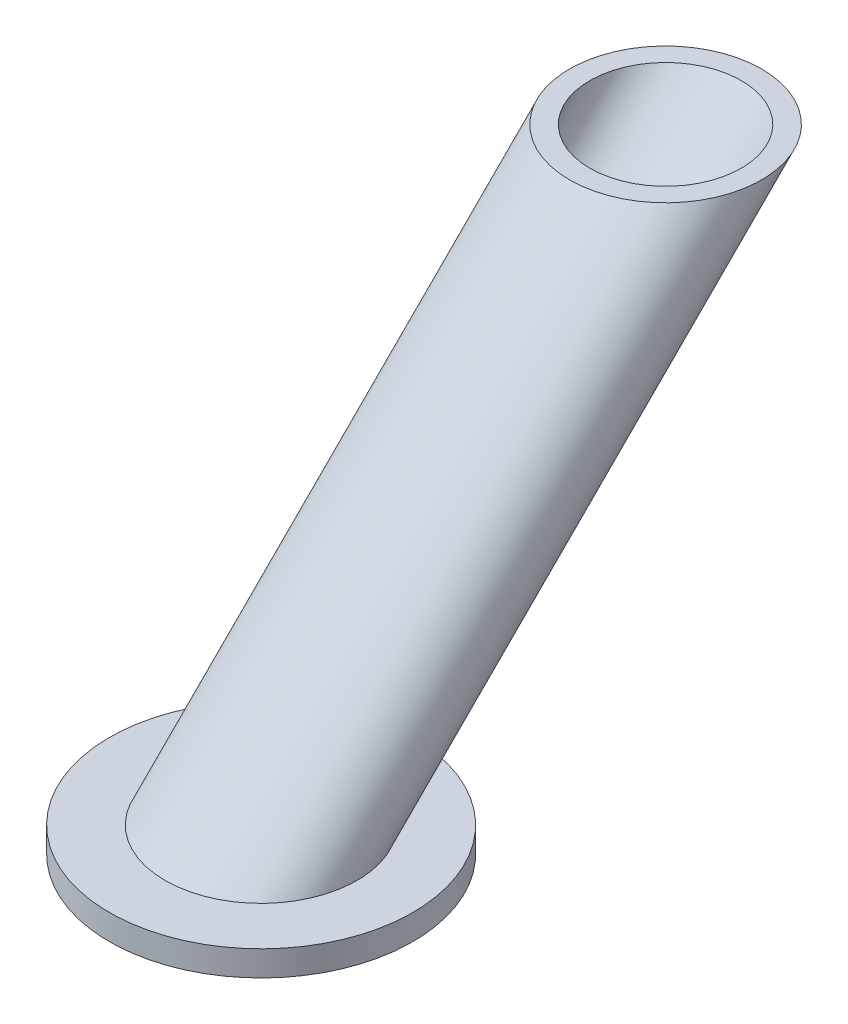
ISO-10303-21;
HEADER;
FILE_DESCRIPTION(('STEP AP214'),'2;1');
FILE_NAME('part.step','',(''),(''),'','','');
FILE_SCHEMA(('AUTOMOTIVE_DESIGN { 1 0 10303 214 1 1 1 1 }'));
ENDSEC;
DATA;
#1=APPLICATION_CONTEXT('core data for automotive mechanical design processes');
#2=APPLICATION_PROTOCOL_DEFINITION('international standard','automotive_design',2000,#1);
#3=PRODUCT_CONTEXT('',#1,'mechanical');
#4=PRODUCT('Part','Part','',(#3));
#5=PRODUCT_RELATED_PRODUCT_CATEGORY('part','',(#4));
#6=PRODUCT_DEFINITION_FORMATION('','',#4);
#7=PRODUCT_DEFINITION_CONTEXT('part definition',#1,'design');
#8=PRODUCT_DEFINITION('design','',#6,#7);
#9=PRODUCT_DEFINITION_SHAPE('','',#8);
#10=(LENGTH_UNIT() NAMED_UNIT(*) SI_UNIT(.MILLI.,.METRE.));
#11=(NAMED_UNIT(*) PLANE_ANGLE_UNIT() SI_UNIT($,.RADIAN.));
#12=(NAMED_UNIT(*) SI_UNIT($,.STERADIAN.) SOLID_ANGLE_UNIT());
#13=UNCERTAINTY_MEASURE_WITH_UNIT(LENGTH_MEASURE(1.E-05),#10,'distance_accuracy_value','');
#14=(GEOMETRIC_REPRESENTATION_CONTEXT(3) GLOBAL_UNCERTAINTY_ASSIGNED_CONTEXT((#13)) GLOBAL_UNIT_ASSIGNED_CONTEXT((#10,
#11,#12)) REPRESENTATION_CONTEXT('',''));
#15=CARTESIAN_POINT('',(0.,0.,0.));
#16=DIRECTION('',(0.,0.,1.));
#17=DIRECTION('',(1.,0.,0.));
#18=AXIS2_PLACEMENT_3D('',#15,#16,#17);
#19=CARTESIAN_POINT('',(0.,-101.6,101.6));
#20=DIRECTION('',(0.,1.,0.));
#21=DIRECTION('',(0.,0.,1.));
#22=AXIS2_PLACEMENT_3D('',#19,#20,#21);
#23=CIRCLE('',#22,19.05);
#24=DIRECTION('',(0.,0.707106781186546,-0.707106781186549));
#25=VECTOR('',#24,1.);
#26=SURFACE_OF_LINEAR_EXTRUSION('',#23,#25);
#27=CARTESIAN_POINT('',(0.,-101.6,120.65));
#28=VERTEX_POINT('',#27);
#29=EDGE_CURVE('E10',#28,#28,#23,.T.);
#30=ORIENTED_EDGE('',*,*,#29,.F.);
#31=EDGE_LOOP('',(#30));
#32=FACE_BOUND('',#31,.T.);
#33=CARTESIAN_POINT('',(0.,0.,0.));
#34=DIRECTION('',(0.,1.,0.));
#35=DIRECTION('',(0.,0.,1.));
#36=AXIS2_PLACEMENT_3D('',#33,#34,#35);
#37=CIRCLE('',#36,19.05);
#38=CARTESIAN_POINT('',(0.,0.,19.05));
#39=VERTEX_POINT('',#38);
#40=EDGE_CURVE('E367',#39,#39,#37,.T.);
#41=ORIENTED_EDGE('',*,*,#40,.T.);
#42=EDGE_LOOP('',(#41));
#43=FACE_BOUND('',#42,.T.);
#44=ADVANCED_FACE('F356',(#32,#43),#26,.F.);
#45=CARTESIAN_POINT('',(0.,-101.6,101.6));
#46=DIRECTION('',(0.,1.,0.));
#47=DIRECTION('',(0.,0.,1.));
#48=AXIS2_PLACEMENT_3D('',#45,#46,#47);
#49=CIRCLE('',#48,24.13);
#50=DIRECTION('',(0.,0.707106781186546,-0.707106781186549));
#51=VECTOR('',#50,1.);
#52=SURFACE_OF_LINEAR_EXTRUSION('',#49,#51);
#53=CARTESIAN_POINT('',(0.,-101.6,101.6));
#54=DIRECTION('',(0.,1.,0.));
#55=DIRECTION('',(0.,0.,1.));
#56=AXIS2_PLACEMENT_3D('',#53,#54,#55);
#57=CIRCLE('',#56,24.13);
#58=CARTESIAN_POINT('',(0.,-101.6,125.73));
#59=VERTEX_POINT('',#58);
#60=EDGE_CURVE('E373',#59,#59,#57,.T.);
#61=ORIENTED_EDGE('',*,*,#60,.T.);
#62=EDGE_LOOP('',(#61));
#63=FACE_BOUND('',#62,.T.);
#64=CARTESIAN_POINT('',(0.,0.,0.));
#65=DIRECTION('',(0.,1.,0.));
#66=DIRECTION('',(0.,0.,1.));
#67=AXIS2_PLACEMENT_3D('',#64,#65,#66);
#68=CIRCLE('',#67,24.13);
#69=CARTESIAN_POINT('',(0.,0.,24.13));
#70=VERTEX_POINT('',#69);
#71=EDGE_CURVE('E363',#70,#70,#68,.T.);
#72=ORIENTED_EDGE('',*,*,#71,.F.);
#73=EDGE_LOOP('',(#72));
#74=FACE_BOUND('',#73,.T.);
#75=ADVANCED_FACE('F402',(#63,#74),#52,.T.);
#76=CARTESIAN_POINT('',(0.,0.,0.));
#77=DIRECTION('',(0.,1.,0.));
#78=DIRECTION('',(0.,0.,1.));
#79=AXIS2_PLACEMENT_3D('',#76,#77,#78);
#80=PLANE('',#79);
#81=ORIENTED_EDGE('',*,*,#40,.F.);
#82=EDGE_LOOP('',(#81));
#83=FACE_BOUND('',#82,.T.);
#84=ORIENTED_EDGE('',*,*,#71,.T.);
#85=EDGE_LOOP('',(#84));
#86=FACE_BOUND('',#85,.T.);
#87=ADVANCED_FACE('F391',(#83,#86),#80,.T.);
#88=CARTESIAN_POINT('',(0.,-107.95,101.6));
#89=DIRECTION('',(0.,-1.,0.));
#90=DIRECTION('',(0.,0.,-1.));
#91=AXIS2_PLACEMENT_3D('',#88,#89,#90);
#92=PLANE('',#91);
#93=CARTESIAN_POINT('',(0.,-107.95,101.6));
#94=DIRECTION('',(0.,-1.,0.));
#95=DIRECTION('',(0.,0.,-1.));
#96=AXIS2_PLACEMENT_3D('',#93,#94,#95);
#97=CIRCLE('',#96,38.1);
#98=CARTESIAN_POINT('',(0.,-107.95,63.5000000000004));
#99=VERTEX_POINT('',#98);
#100=EDGE_CURVE('E376',#99,#99,#97,.T.);
#101=ORIENTED_EDGE('',*,*,#100,.T.);
#102=EDGE_LOOP('',(#101));
#103=FACE_BOUND('',#102,.T.);
#104=CARTESIAN_POINT('',(0.,-107.95,101.6));
#105=DIRECTION('',(0.,-1.,0.));
#106=DIRECTION('',(0.,0.,-1.));
#107=AXIS2_PLACEMENT_3D('',#104,#105,#106);
#108=CIRCLE('',#107,19.05);
#109=CARTESIAN_POINT('',(0.,-107.95,82.5500000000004));
#110=VERTEX_POINT('',#109);
#111=EDGE_CURVE('E382',#110,#110,#108,.T.);
#112=ORIENTED_EDGE('',*,*,#111,.F.);
#113=EDGE_LOOP('',(#112));
#114=FACE_BOUND('',#113,.T.);
#115=ADVANCED_FACE('F388',(#103,#114),#92,.T.);
#116=CARTESIAN_POINT('',(0.,-101.6,101.6));
#117=DIRECTION('',(0.,-1.,0.));
#118=DIRECTION('',(0.,0.,-1.));
#119=AXIS2_PLACEMENT_3D('',#116,#117,#118);
#120=PLANE('',#119);
#121=ORIENTED_EDGE('',*,*,#60,.F.);
#122=EDGE_LOOP('',(#121));
#123=FACE_BOUND('',#122,.T.);
#124=CARTESIAN_POINT('',(0.,-101.6,101.6));
#125=DIRECTION('',(0.,-1.,0.));
#126=DIRECTION('',(0.,0.,-1.));
#127=AXIS2_PLACEMENT_3D('',#124,#125,#126);
#128=CIRCLE('',#127,38.1);
#129=CARTESIAN_POINT('',(0.,-101.6,63.5000000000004));
#130=VERTEX_POINT('',#129);
#131=EDGE_CURVE('E379',#130,#130,#128,.T.);
#132=ORIENTED_EDGE('',*,*,#131,.F.);
#133=EDGE_LOOP('',(#132));
#134=FACE_BOUND('',#133,.T.);
#135=ADVANCED_FACE('F390',(#123,#134),#120,.F.);
#136=CARTESIAN_POINT('',(0.,-107.95,101.6));
#137=DIRECTION('',(0.,1.,0.));
#138=DIRECTION('',(0.,0.,1.));
#139=AXIS2_PLACEMENT_3D('',#136,#137,#138);
#140=CYLINDRICAL_SURFACE('',#139,38.1);
#141=ORIENTED_EDGE('',*,*,#100,.F.);
#142=EDGE_LOOP('',(#141));
#143=FACE_BOUND('',#142,.T.);
#144=ORIENTED_EDGE('',*,*,#131,.T.);
#145=EDGE_LOOP('',(#144));
#146=FACE_BOUND('',#145,.T.);
#147=ADVANCED_FACE('F398',(#143,#146),#140,.T.);
#148=CARTESIAN_POINT('',(0.,-107.95,101.6));
#149=DIRECTION('',(0.,1.,0.));
#150=DIRECTION('',(0.,0.,1.));
#151=AXIS2_PLACEMENT_3D('',#148,#149,#150);
#152=CYLINDRICAL_SURFACE('',#151,19.05);
#153=ORIENTED_EDGE('',*,*,#111,.T.);
#154=EDGE_LOOP('',(#153));
#155=FACE_BOUND('',#154,.T.);
#156=ORIENTED_EDGE('',*,*,#29,.T.);
#157=EDGE_LOOP('',(#156));
#158=FACE_BOUND('',#157,.T.);
#159=ADVANCED_FACE('F386',(#155,#158),#152,.F.);
#160=CLOSED_SHELL('',(#44,#75,#87,#115,#135,#147,#159));
#161=MANIFOLD_SOLID_BREP('B2',#160);
#162=ADVANCED_BREP_SHAPE_REPRESENTATION('',(#18,#161),#14);
#163=SHAPE_DEFINITION_REPRESENTATION(#9,#162);
ENDSEC;
END-ISO-10303-21;
